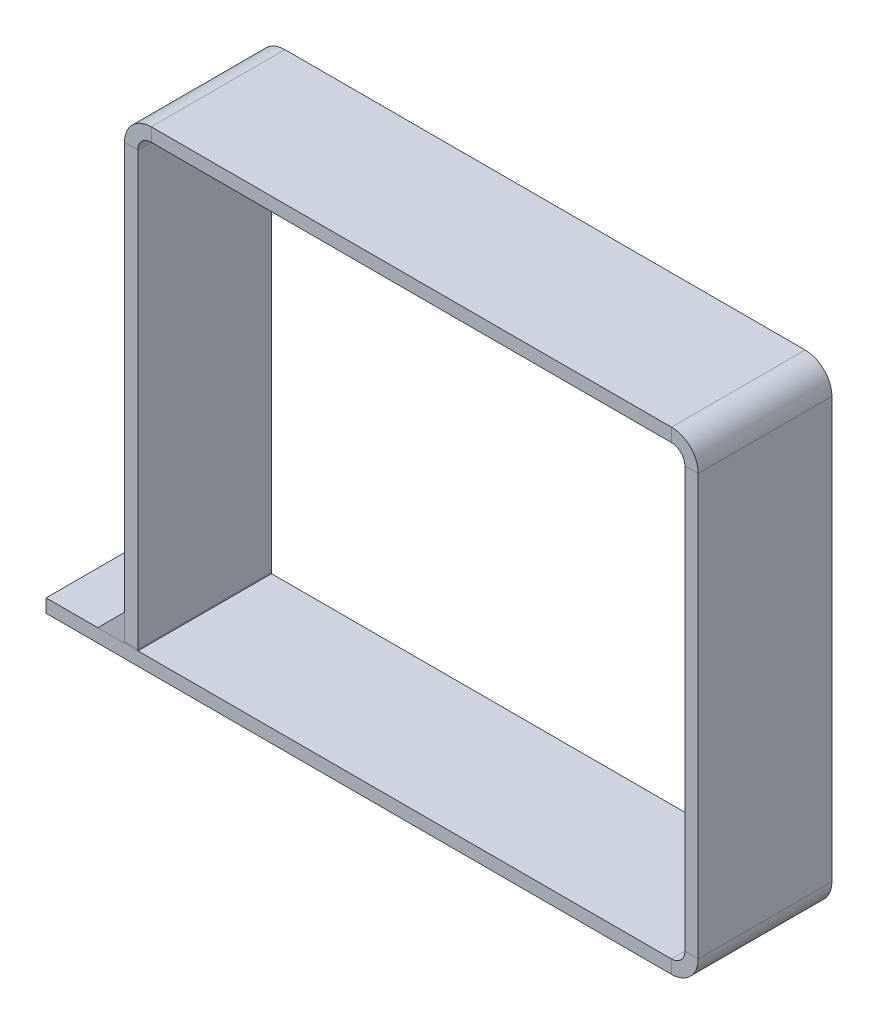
ISO-10303-21;
HEADER;
FILE_DESCRIPTION(('STEP AP214'),'2;1');
FILE_NAME('part.step','',(''),(''),'','','');
FILE_SCHEMA(('AUTOMOTIVE_DESIGN { 1 0 10303 214 1 1 1 1 }'));
ENDSEC;
DATA;
#1=APPLICATION_CONTEXT('core data for automotive mechanical design processes');
#2=APPLICATION_PROTOCOL_DEFINITION('international standard','automotive_design',2000,#1);
#3=PRODUCT_CONTEXT('',#1,'mechanical');
#4=PRODUCT('Part','Part','',(#3));
#5=PRODUCT_RELATED_PRODUCT_CATEGORY('part','',(#4));
#6=PRODUCT_DEFINITION_FORMATION('','',#4);
#7=PRODUCT_DEFINITION_CONTEXT('part definition',#1,'design');
#8=PRODUCT_DEFINITION('design','',#6,#7);
#9=PRODUCT_DEFINITION_SHAPE('','',#8);
#10=(LENGTH_UNIT() NAMED_UNIT(*) SI_UNIT(.MILLI.,.METRE.));
#11=(NAMED_UNIT(*) PLANE_ANGLE_UNIT() SI_UNIT($,.RADIAN.));
#12=(NAMED_UNIT(*) SI_UNIT($,.STERADIAN.) SOLID_ANGLE_UNIT());
#13=UNCERTAINTY_MEASURE_WITH_UNIT(LENGTH_MEASURE(1.E-05),#10,'distance_accuracy_value','');
#14=(GEOMETRIC_REPRESENTATION_CONTEXT(3) GLOBAL_UNCERTAINTY_ASSIGNED_CONTEXT((#13)) GLOBAL_UNIT_ASSIGNED_CONTEXT((#10,
#11,#12)) REPRESENTATION_CONTEXT('',''));
#15=CARTESIAN_POINT('',(0.,0.,0.));
#16=DIRECTION('',(0.,0.,1.));
#17=DIRECTION('',(1.,0.,0.));
#18=AXIS2_PLACEMENT_3D('',#15,#16,#17);
#19=CARTESIAN_POINT('',(7.86589769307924,32.4486459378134,10.));
#20=DIRECTION('',(0.,0.,-1.));
#21=DIRECTION('',(-1.,0.,0.));
#22=AXIS2_PLACEMENT_3D('',#19,#20,#21);
#23=PLANE('',#22);
#24=DIRECTION('',(-0.707106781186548,-0.707106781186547,0.));
#25=VECTOR('',#24,1.);
#26=CARTESIAN_POINT('',(22.090220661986,18.2243229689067,10.));
#27=LINE('',#26,#25);
#28=CARTESIAN_POINT('',(5.86589769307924,1.99999999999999,10.));
#29=VERTEX_POINT('',#28);
#30=CARTESIAN_POINT('',(3.86589769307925,0.,10.));
#31=VERTEX_POINT('',#30);
#32=EDGE_CURVE('E12',#29,#31,#27,.T.);
#33=ORIENTED_EDGE('',*,*,#32,.T.);
#34=DIRECTION('',(1.,0.,0.));
#35=VECTOR('',#34,1.);
#36=CARTESIAN_POINT('',(0.,0.,10.));
#37=LINE('',#36,#35);
#38=CARTESIAN_POINT('',(5.86589769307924,0.,10.));
#39=VERTEX_POINT('',#38);
#40=EDGE_CURVE('E85',#31,#39,#37,.T.);
#41=ORIENTED_EDGE('',*,*,#40,.T.);
#42=DIRECTION('',(0.,-1.,0.));
#43=VECTOR('',#42,1.);
#44=CARTESIAN_POINT('',(5.86589769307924,33.4486459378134,10.));
#45=LINE('',#44,#43);
#46=EDGE_CURVE('E76',#29,#39,#45,.T.);
#47=ORIENTED_EDGE('',*,*,#46,.F.);
#48=EDGE_LOOP('',(#33,#41,#47));
#49=FACE_BOUND('',#48,.T.);
#50=ADVANCED_FACE('F43',(#49),#23,.F.);
#51=CARTESIAN_POINT('',(7.86589769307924,32.4486459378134,0.));
#52=DIRECTION('',(0.,0.,-1.));
#53=DIRECTION('',(-1.,0.,0.));
#54=AXIS2_PLACEMENT_3D('',#51,#52,#53);
#55=PLANE('',#54);
#56=DIRECTION('',(1.,0.,0.));
#57=VECTOR('',#56,1.);
#58=CARTESIAN_POINT('',(0.,0.,0.));
#59=LINE('',#58,#57);
#60=CARTESIAN_POINT('',(3.86589769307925,0.,0.));
#61=VERTEX_POINT('',#60);
#62=CARTESIAN_POINT('',(5.86589769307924,0.,0.));
#63=VERTEX_POINT('',#62);
#64=EDGE_CURVE('E86',#61,#63,#59,.T.);
#65=ORIENTED_EDGE('',*,*,#64,.F.);
#66=DIRECTION('',(0.707106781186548,0.707106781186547,0.));
#67=VECTOR('',#66,1.);
#68=CARTESIAN_POINT('',(3.86589769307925,0.,0.));
#69=LINE('',#68,#67);
#70=CARTESIAN_POINT('',(5.86589769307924,1.99999999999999,0.));
#71=VERTEX_POINT('',#70);
#72=EDGE_CURVE('E50',#61,#71,#69,.T.);
#73=ORIENTED_EDGE('',*,*,#72,.T.);
#74=DIRECTION('',(0.,-1.,0.));
#75=VECTOR('',#74,1.);
#76=CARTESIAN_POINT('',(5.86589769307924,33.4486459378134,0.));
#77=LINE('',#76,#75);
#78=EDGE_CURVE('E57',#71,#63,#77,.T.);
#79=ORIENTED_EDGE('',*,*,#78,.T.);
#80=EDGE_LOOP('',(#65,#73,#79));
#81=FACE_BOUND('',#80,.T.);
#82=ADVANCED_FACE('F96',(#81),#55,.T.);
#83=CARTESIAN_POINT('',(3.86589769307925,0.,10.));
#84=DIRECTION('',(0.707106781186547,-0.707106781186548,0.));
#85=DIRECTION('',(0.707106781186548,0.707106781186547,0.));
#86=AXIS2_PLACEMENT_3D('',#83,#84,#85);
#87=PLANE('',#86);
#88=ORIENTED_EDGE('',*,*,#32,.F.);
#89=DIRECTION('',(0.,0.,1.));
#90=VECTOR('',#89,1.);
#91=CARTESIAN_POINT('',(5.86589769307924,1.99999999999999,10.));
#92=LINE('',#91,#90);
#93=EDGE_CURVE('E81',#71,#29,#92,.T.);
#94=ORIENTED_EDGE('',*,*,#93,.F.);
#95=ORIENTED_EDGE('',*,*,#72,.F.);
#96=DIRECTION('',(0.,0.,-1.));
#97=VECTOR('',#96,1.);
#98=CARTESIAN_POINT('',(3.86589769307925,0.,10.));
#99=LINE('',#98,#97);
#100=EDGE_CURVE('E65',#31,#61,#99,.T.);
#101=ORIENTED_EDGE('',*,*,#100,.F.);
#102=EDGE_LOOP('',(#88,#94,#95,#101));
#103=FACE_BOUND('',#102,.T.);
#104=ADVANCED_FACE('F98',(#103),#87,.F.);
#105=CARTESIAN_POINT('',(0.,0.,10.));
#106=DIRECTION('',(0.,1.,0.));
#107=DIRECTION('',(0.,0.,1.));
#108=AXIS2_PLACEMENT_3D('',#105,#106,#107);
#109=PLANE('',#108);
#110=ORIENTED_EDGE('',*,*,#64,.T.);
#111=DIRECTION('',(0.,0.,-1.));
#112=VECTOR('',#111,1.);
#113=CARTESIAN_POINT('',(5.86589769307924,0.,10.));
#114=LINE('',#113,#112);
#115=EDGE_CURVE('E79',#39,#63,#114,.T.);
#116=ORIENTED_EDGE('',*,*,#115,.F.);
#117=ORIENTED_EDGE('',*,*,#40,.F.);
#118=ORIENTED_EDGE('',*,*,#100,.T.);
#119=EDGE_LOOP('',(#110,#116,#117,#118));
#120=FACE_BOUND('',#119,.T.);
#121=ADVANCED_FACE('F88',(#120),#109,.F.);
#122=CARTESIAN_POINT('',(5.86589769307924,33.4486459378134,10.));
#123=DIRECTION('',(1.,0.,0.));
#124=DIRECTION('',(0.,1.,0.));
#125=AXIS2_PLACEMENT_3D('',#122,#123,#124);
#126=PLANE('',#125);
#127=ORIENTED_EDGE('',*,*,#93,.T.);
#128=ORIENTED_EDGE('',*,*,#46,.T.);
#129=ORIENTED_EDGE('',*,*,#115,.T.);
#130=ORIENTED_EDGE('',*,*,#78,.F.);
#131=EDGE_LOOP('',(#127,#128,#129,#130));
#132=FACE_BOUND('',#131,.T.);
#133=ADVANCED_FACE('F78',(#132),#126,.T.);
#134=CLOSED_SHELL('',(#50,#82,#104,#121,#133));
#135=MANIFOLD_SOLID_BREP('B2',#134);
#136=CARTESIAN_POINT('',(5.86589769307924,0.,10.));
#137=DIRECTION('',(1.,0.,0.));
#138=DIRECTION('',(0.,1.,0.));
#139=AXIS2_PLACEMENT_3D('',#136,#137,#138);
#140=PLANE('',#139);
#141=DIRECTION('',(0.,0.,-1.));
#142=VECTOR('',#141,1.);
#143=CARTESIAN_POINT('',(5.86589769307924,0.100000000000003,10.));
#144=LINE('',#143,#142);
#145=CARTESIAN_POINT('',(5.86589769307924,0.100000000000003,10.));
#146=VERTEX_POINT('',#145);
#147=CARTESIAN_POINT('',(5.86589769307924,0.100000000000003,0.));
#148=VERTEX_POINT('',#147);
#149=EDGE_CURVE('E197',#146,#148,#144,.T.);
#150=ORIENTED_EDGE('',*,*,#149,.T.);
#151=DIRECTION('',(0.,1.,0.));
#152=VECTOR('',#151,1.);
#153=CARTESIAN_POINT('',(5.86589769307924,0.,0.));
#154=LINE('',#153,#152);
#155=CARTESIAN_POINT('',(5.86589769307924,0.,0.));
#156=VERTEX_POINT('',#155);
#157=EDGE_CURVE('E41',#156,#148,#154,.T.);
#158=ORIENTED_EDGE('',*,*,#157,.F.);
#159=DIRECTION('',(0.,0.,-1.));
#160=VECTOR('',#159,1.);
#161=CARTESIAN_POINT('',(5.86589769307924,0.,10.));
#162=LINE('',#161,#160);
#163=CARTESIAN_POINT('',(5.86589769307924,0.,10.));
#164=VERTEX_POINT('',#163);
#165=EDGE_CURVE('E215',#164,#156,#162,.T.);
#166=ORIENTED_EDGE('',*,*,#165,.F.);
#167=DIRECTION('',(0.,1.,0.));
#168=VECTOR('',#167,1.);
#169=CARTESIAN_POINT('',(5.86589769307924,0.,10.));
#170=LINE('',#169,#168);
#171=EDGE_CURVE('E209',#164,#146,#170,.T.);
#172=ORIENTED_EDGE('',*,*,#171,.T.);
#173=EDGE_LOOP('',(#150,#158,#166,#172));
#174=FACE_BOUND('',#173,.T.);
#175=ADVANCED_FACE('F153',(#174),#140,.F.);
#176=CARTESIAN_POINT('',(5.86589769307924,0.,0.));
#177=DIRECTION('',(0.,0.,1.));
#178=DIRECTION('',(1.,0.,0.));
#179=AXIS2_PLACEMENT_3D('',#176,#177,#178);
#180=PLANE('',#179);
#181=DIRECTION('',(1.,0.,0.));
#182=VECTOR('',#181,1.);
#183=CARTESIAN_POINT('',(5.86589769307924,0.100000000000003,0.));
#184=LINE('',#183,#182);
#185=CARTESIAN_POINT('',(6.86589769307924,0.0999999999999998,0.));
#186=VERTEX_POINT('',#185);
#187=EDGE_CURVE('E193',#148,#186,#184,.T.);
#188=ORIENTED_EDGE('',*,*,#187,.T.);
#189=DIRECTION('',(0.,1.,0.));
#190=VECTOR('',#189,1.);
#191=CARTESIAN_POINT('',(6.86589769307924,0.,0.));
#192=LINE('',#191,#190);
#193=CARTESIAN_POINT('',(6.86589769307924,0.,0.));
#194=VERTEX_POINT('',#193);
#195=EDGE_CURVE('E160',#194,#186,#192,.T.);
#196=ORIENTED_EDGE('',*,*,#195,.F.);
#197=DIRECTION('',(1.,0.,0.));
#198=VECTOR('',#197,1.);
#199=CARTESIAN_POINT('',(5.86589769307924,0.,0.));
#200=LINE('',#199,#198);
#201=EDGE_CURVE('E205',#156,#194,#200,.T.);
#202=ORIENTED_EDGE('',*,*,#201,.F.);
#203=ORIENTED_EDGE('',*,*,#157,.T.);
#204=EDGE_LOOP('',(#188,#196,#202,#203));
#205=FACE_BOUND('',#204,.T.);
#206=ADVANCED_FACE('F204',(#205),#180,.F.);
#207=CARTESIAN_POINT('',(6.86589769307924,0.,0.));
#208=DIRECTION('',(-1.,0.,0.));
#209=DIRECTION('',(0.,-1.,0.));
#210=AXIS2_PLACEMENT_3D('',#207,#208,#209);
#211=PLANE('',#210);
#212=DIRECTION('',(0.,0.,1.));
#213=VECTOR('',#212,1.);
#214=CARTESIAN_POINT('',(6.86589769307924,0.0999999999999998,0.));
#215=LINE('',#214,#213);
#216=CARTESIAN_POINT('',(6.86589769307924,0.0999999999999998,10.));
#217=VERTEX_POINT('',#216);
#218=EDGE_CURVE('E198',#186,#217,#215,.T.);
#219=ORIENTED_EDGE('',*,*,#218,.T.);
#220=DIRECTION('',(0.,1.,0.));
#221=VECTOR('',#220,1.);
#222=CARTESIAN_POINT('',(6.86589769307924,0.,10.));
#223=LINE('',#222,#221);
#224=CARTESIAN_POINT('',(6.86589769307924,0.,10.));
#225=VERTEX_POINT('',#224);
#226=EDGE_CURVE('E221',#225,#217,#223,.T.);
#227=ORIENTED_EDGE('',*,*,#226,.F.);
#228=DIRECTION('',(0.,0.,1.));
#229=VECTOR('',#228,1.);
#230=CARTESIAN_POINT('',(6.86589769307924,0.,0.));
#231=LINE('',#230,#229);
#232=EDGE_CURVE('E172',#194,#225,#231,.T.);
#233=ORIENTED_EDGE('',*,*,#232,.F.);
#234=ORIENTED_EDGE('',*,*,#195,.T.);
#235=EDGE_LOOP('',(#219,#227,#233,#234));
#236=FACE_BOUND('',#235,.T.);
#237=ADVANCED_FACE('F224',(#236),#211,.F.);
#238=CARTESIAN_POINT('',(6.86589769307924,0.,10.));
#239=DIRECTION('',(0.,0.,-1.));
#240=DIRECTION('',(-1.,0.,0.));
#241=AXIS2_PLACEMENT_3D('',#238,#239,#240);
#242=PLANE('',#241);
#243=DIRECTION('',(-1.,0.,0.));
#244=VECTOR('',#243,1.);
#245=CARTESIAN_POINT('',(6.86589769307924,0.0999999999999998,10.));
#246=LINE('',#245,#244);
#247=EDGE_CURVE('E213',#217,#146,#246,.T.);
#248=ORIENTED_EDGE('',*,*,#247,.T.);
#249=ORIENTED_EDGE('',*,*,#171,.F.);
#250=DIRECTION('',(-1.,0.,0.));
#251=VECTOR('',#250,1.);
#252=CARTESIAN_POINT('',(6.86589769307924,0.,10.));
#253=LINE('',#252,#251);
#254=EDGE_CURVE('E167',#225,#164,#253,.T.);
#255=ORIENTED_EDGE('',*,*,#254,.F.);
#256=ORIENTED_EDGE('',*,*,#226,.T.);
#257=EDGE_LOOP('',(#248,#249,#255,#256));
#258=FACE_BOUND('',#257,.T.);
#259=ADVANCED_FACE('F226',(#258),#242,.F.);
#260=CARTESIAN_POINT('',(5.86589769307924,0.,0.));
#261=DIRECTION('',(0.,-1.,0.));
#262=DIRECTION('',(1.,0.,0.));
#263=AXIS2_PLACEMENT_3D('',#260,#261,#262);
#264=PLANE('',#263);
#265=ORIENTED_EDGE('',*,*,#165,.T.);
#266=ORIENTED_EDGE('',*,*,#201,.T.);
#267=ORIENTED_EDGE('',*,*,#232,.T.);
#268=ORIENTED_EDGE('',*,*,#254,.T.);
#269=EDGE_LOOP('',(#265,#266,#267,#268));
#270=FACE_BOUND('',#269,.T.);
#271=ADVANCED_FACE('F227',(#270),#264,.T.);
#272=CARTESIAN_POINT('',(5.86589769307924,0.100000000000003,0.));
#273=DIRECTION('',(0.,-1.,0.));
#274=DIRECTION('',(1.,0.,0.));
#275=AXIS2_PLACEMENT_3D('',#272,#273,#274);
#276=PLANE('',#275);
#277=ORIENTED_EDGE('',*,*,#149,.F.);
#278=ORIENTED_EDGE('',*,*,#247,.F.);
#279=ORIENTED_EDGE('',*,*,#218,.F.);
#280=ORIENTED_EDGE('',*,*,#187,.F.);
#281=EDGE_LOOP('',(#277,#278,#279,#280));
#282=FACE_BOUND('',#281,.T.);
#283=ADVANCED_FACE('F194',(#282),#276,.F.);
#284=CLOSED_SHELL('',(#175,#206,#237,#259,#271,#283));
#285=MANIFOLD_SOLID_BREP('B6',#284);
#286=CARTESIAN_POINT('',(47.7810431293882,1.,10.));
#287=DIRECTION('',(0.,0.,1.));
#288=DIRECTION('',(1.,0.,0.));
#289=AXIS2_PLACEMENT_3D('',#286,#287,#288);
#290=PLANE('',#289);
#291=DIRECTION('',(1.,0.,0.));
#292=VECTOR('',#291,1.);
#293=CARTESIAN_POINT('',(47.7810431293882,1.,10.));
#294=LINE('',#293,#292);
#295=CARTESIAN_POINT('',(47.7810431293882,1.,10.));
#296=VERTEX_POINT('',#295);
#297=CARTESIAN_POINT('',(48.7810431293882,1.,10.));
#298=VERTEX_POINT('',#297);
#299=EDGE_CURVE('E151',#296,#298,#294,.T.);
#300=ORIENTED_EDGE('',*,*,#299,.F.);
#301=CARTESIAN_POINT('',(46.7810431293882,1.,10.));
#302=DIRECTION('',(0.,0.,-1.));
#303=DIRECTION('',(-1.,0.,0.));
#304=AXIS2_PLACEMENT_3D('',#301,#302,#303);
#305=CIRCLE('',#304,1.);
#306=CARTESIAN_POINT('',(46.7810431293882,0.,10.));
#307=VERTEX_POINT('',#306);
#308=EDGE_CURVE('E462',#307,#296,#305,.F.);
#309=ORIENTED_EDGE('',*,*,#308,.F.);
#310=DIRECTION('',(0.,1.,0.));
#311=VECTOR('',#310,1.);
#312=CARTESIAN_POINT('',(46.7810431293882,-1.,10.));
#313=LINE('',#312,#311);
#314=CARTESIAN_POINT('',(46.7810431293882,-1.,10.));
#315=VERTEX_POINT('',#314);
#316=EDGE_CURVE('E273',#315,#307,#313,.T.);
#317=ORIENTED_EDGE('',*,*,#316,.F.);
#318=CARTESIAN_POINT('',(46.7810431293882,1.,10.));
#319=DIRECTION('',(0.,0.,1.));
#320=DIRECTION('',(1.,0.,0.));
#321=AXIS2_PLACEMENT_3D('',#318,#319,#320);
#322=CIRCLE('',#321,2.);
#323=EDGE_CURVE('E474',#315,#298,#322,.T.);
#324=ORIENTED_EDGE('',*,*,#323,.T.);
#325=EDGE_LOOP('',(#300,#309,#317,#324));
#326=FACE_BOUND('',#325,.T.);
#327=ADVANCED_FACE('F266',(#326),#290,.T.);
#328=CARTESIAN_POINT('',(46.7810431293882,-1.,10.));
#329=DIRECTION('',(0.,0.,1.));
#330=DIRECTION('',(1.,0.,0.));
#331=AXIS2_PLACEMENT_3D('',#328,#329,#330);
#332=PLANE('',#331);
#333=DIRECTION('',(0.,1.,0.));
#334=VECTOR('',#333,1.);
#335=CARTESIAN_POINT('',(47.7810431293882,0.,10.));
#336=LINE('',#335,#334);
#337=CARTESIAN_POINT('',(47.7810431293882,32.4486459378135,10.));
#338=VERTEX_POINT('',#337);
#339=EDGE_CURVE('E459',#296,#338,#336,.T.);
#340=ORIENTED_EDGE('',*,*,#339,.F.);
#341=ORIENTED_EDGE('',*,*,#299,.T.);
#342=DIRECTION('',(0.,1.,0.));
#343=VECTOR('',#342,1.);
#344=CARTESIAN_POINT('',(48.7810431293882,0.,10.));
#345=LINE('',#344,#343);
#346=CARTESIAN_POINT('',(48.7810431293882,32.4486459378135,10.));
#347=VERTEX_POINT('',#346);
#348=EDGE_CURVE('E477',#298,#347,#345,.T.);
#349=ORIENTED_EDGE('',*,*,#348,.T.);
#350=DIRECTION('',(-1.,0.,0.));
#351=VECTOR('',#350,1.);
#352=CARTESIAN_POINT('',(48.7810431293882,32.4486459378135,10.));
#353=LINE('',#352,#351);
#354=EDGE_CURVE('E535',#347,#338,#353,.T.);
#355=ORIENTED_EDGE('',*,*,#354,.T.);
#356=EDGE_LOOP('',(#340,#341,#349,#355));
#357=FACE_BOUND('',#356,.T.);
#358=ADVANCED_FACE('F577',(#357),#332,.T.);
#359=CARTESIAN_POINT('',(46.7810431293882,0.,0.));
#360=DIRECTION('',(0.,0.,-1.));
#361=DIRECTION('',(-1.,0.,0.));
#362=AXIS2_PLACEMENT_3D('',#359,#360,#361);
#363=PLANE('',#362);
#364=DIRECTION('',(0.,-1.,0.));
#365=VECTOR('',#364,1.);
#366=CARTESIAN_POINT('',(46.7810431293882,0.,0.));
#367=LINE('',#366,#365);
#368=CARTESIAN_POINT('',(46.7810431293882,0.,0.));
#369=VERTEX_POINT('',#368);
#370=CARTESIAN_POINT('',(46.7810431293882,-1.,0.));
#371=VERTEX_POINT('',#370);
#372=EDGE_CURVE('E541',#369,#371,#367,.T.);
#373=ORIENTED_EDGE('',*,*,#372,.F.);
#374=CARTESIAN_POINT('',(46.7810431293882,1.,0.));
#375=DIRECTION('',(0.,0.,-1.));
#376=DIRECTION('',(-1.,0.,0.));
#377=AXIS2_PLACEMENT_3D('',#374,#375,#376);
#378=CIRCLE('',#377,1.);
#379=CARTESIAN_POINT('',(47.7810431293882,1.,0.));
#380=VERTEX_POINT('',#379);
#381=EDGE_CURVE('E417',#369,#380,#378,.F.);
#382=ORIENTED_EDGE('',*,*,#381,.T.);
#383=DIRECTION('',(-1.,0.,0.));
#384=VECTOR('',#383,1.);
#385=CARTESIAN_POINT('',(48.7810431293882,1.,0.));
#386=LINE('',#385,#384);
#387=CARTESIAN_POINT('',(48.7810431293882,1.,0.));
#388=VERTEX_POINT('',#387);
#389=EDGE_CURVE('E539',#388,#380,#386,.T.);
#390=ORIENTED_EDGE('',*,*,#389,.F.);
#391=CARTESIAN_POINT('',(46.7810431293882,1.,0.));
#392=DIRECTION('',(0.,0.,1.));
#393=DIRECTION('',(1.,0.,0.));
#394=AXIS2_PLACEMENT_3D('',#391,#392,#393);
#395=CIRCLE('',#394,2.);
#396=EDGE_CURVE('E429',#371,#388,#395,.T.);
#397=ORIENTED_EDGE('',*,*,#396,.F.);
#398=EDGE_LOOP('',(#373,#382,#390,#397));
#399=FACE_BOUND('',#398,.T.);
#400=ADVANCED_FACE('F585',(#399),#363,.T.);
#401=CARTESIAN_POINT('',(48.7810431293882,1.,0.));
#402=DIRECTION('',(0.,0.,-1.));
#403=DIRECTION('',(-1.,0.,0.));
#404=AXIS2_PLACEMENT_3D('',#401,#402,#403);
#405=PLANE('',#404);
#406=DIRECTION('',(1.,0.,0.));
#407=VECTOR('',#406,1.);
#408=CARTESIAN_POINT('',(0.,0.,0.));
#409=LINE('',#408,#407);
#410=CARTESIAN_POINT('',(0.,0.,0.));
#411=VERTEX_POINT('',#410);
#412=EDGE_CURVE('E420',#411,#369,#409,.T.);
#413=ORIENTED_EDGE('',*,*,#412,.T.);
#414=ORIENTED_EDGE('',*,*,#372,.T.);
#415=DIRECTION('',(1.,0.,0.));
#416=VECTOR('',#415,1.);
#417=CARTESIAN_POINT('',(0.,-1.,0.));
#418=LINE('',#417,#416);
#419=CARTESIAN_POINT('',(0.,-1.,0.));
#420=VERTEX_POINT('',#419);
#421=EDGE_CURVE('E426',#420,#371,#418,.T.);
#422=ORIENTED_EDGE('',*,*,#421,.F.);
#423=DIRECTION('',(0.,1.,0.));
#424=VECTOR('',#423,1.);
#425=CARTESIAN_POINT('',(0.,-1.,0.));
#426=LINE('',#425,#424);
#427=EDGE_CURVE('E423',#420,#411,#426,.T.);
#428=ORIENTED_EDGE('',*,*,#427,.T.);
#429=EDGE_LOOP('',(#413,#414,#422,#428));
#430=FACE_BOUND('',#429,.T.);
#431=ADVANCED_FACE('F587',(#430),#405,.T.);
#432=CARTESIAN_POINT('',(46.7810431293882,33.4486459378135,10.));
#433=DIRECTION('',(0.,0.,1.));
#434=DIRECTION('',(1.,0.,0.));
#435=AXIS2_PLACEMENT_3D('',#432,#433,#434);
#436=PLANE('',#435);
#437=DIRECTION('',(0.,1.,0.));
#438=VECTOR('',#437,1.);
#439=CARTESIAN_POINT('',(46.7810431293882,33.4486459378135,10.));
#440=LINE('',#439,#438);
#441=CARTESIAN_POINT('',(46.7810431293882,33.4486459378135,10.));
#442=VERTEX_POINT('',#441);
#443=CARTESIAN_POINT('',(46.7810431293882,34.4486459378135,10.));
#444=VERTEX_POINT('',#443);
#445=EDGE_CURVE('E537',#442,#444,#440,.T.);
#446=ORIENTED_EDGE('',*,*,#445,.F.);
#447=CARTESIAN_POINT('',(46.7810431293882,32.4486459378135,10.));
#448=DIRECTION('',(0.,0.,-1.));
#449=DIRECTION('',(-1.,0.,0.));
#450=AXIS2_PLACEMENT_3D('',#447,#448,#449);
#451=CIRCLE('',#450,1.);
#452=EDGE_CURVE('E456',#338,#442,#451,.F.);
#453=ORIENTED_EDGE('',*,*,#452,.F.);
#454=ORIENTED_EDGE('',*,*,#354,.F.);
#455=CARTESIAN_POINT('',(46.7810431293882,32.4486459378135,10.));
#456=DIRECTION('',(0.,0.,1.));
#457=DIRECTION('',(1.,0.,0.));
#458=AXIS2_PLACEMENT_3D('',#455,#456,#457);
#459=CIRCLE('',#458,2.);
#460=EDGE_CURVE('E480',#347,#444,#459,.T.);
#461=ORIENTED_EDGE('',*,*,#460,.T.);
#462=EDGE_LOOP('',(#446,#453,#454,#461));
#463=FACE_BOUND('',#462,.T.);
#464=ADVANCED_FACE('F589',(#463),#436,.T.);
#465=CARTESIAN_POINT('',(48.7810431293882,32.4486459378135,10.));
#466=DIRECTION('',(0.,0.,1.));
#467=DIRECTION('',(1.,0.,0.));
#468=AXIS2_PLACEMENT_3D('',#465,#466,#467);
#469=PLANE('',#468);
#470=DIRECTION('',(-1.,0.,0.));
#471=VECTOR('',#470,1.);
#472=CARTESIAN_POINT('',(47.7810431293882,33.4486459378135,10.));
#473=LINE('',#472,#471);
#474=CARTESIAN_POINT('',(7.86589769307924,33.4486459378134,10.));
#475=VERTEX_POINT('',#474);
#476=EDGE_CURVE('E453',#442,#475,#473,.T.);
#477=ORIENTED_EDGE('',*,*,#476,.F.);
#478=ORIENTED_EDGE('',*,*,#445,.T.);
#479=DIRECTION('',(-1.,0.,0.));
#480=VECTOR('',#479,1.);
#481=CARTESIAN_POINT('',(47.7810431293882,34.4486459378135,10.));
#482=LINE('',#481,#480);
#483=CARTESIAN_POINT('',(7.86589769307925,34.4486459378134,10.));
#484=VERTEX_POINT('',#483);
#485=EDGE_CURVE('E483',#444,#484,#482,.T.);
#486=ORIENTED_EDGE('',*,*,#485,.T.);
#487=DIRECTION('',(0.,-1.,0.));
#488=VECTOR('',#487,1.);
#489=CARTESIAN_POINT('',(7.86589769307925,34.4486459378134,10.));
#490=LINE('',#489,#488);
#491=EDGE_CURVE('E287',#484,#475,#490,.T.);
#492=ORIENTED_EDGE('',*,*,#491,.T.);
#493=EDGE_LOOP('',(#477,#478,#486,#492));
#494=FACE_BOUND('',#493,.T.);
#495=ADVANCED_FACE('F595',(#494),#469,.T.);
#496=CARTESIAN_POINT('',(47.7810431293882,32.4486459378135,0.));
#497=DIRECTION('',(0.,0.,-1.));
#498=DIRECTION('',(-1.,0.,0.));
#499=AXIS2_PLACEMENT_3D('',#496,#497,#498);
#500=PLANE('',#499);
#501=DIRECTION('',(1.,0.,0.));
#502=VECTOR('',#501,1.);
#503=CARTESIAN_POINT('',(47.7810431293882,32.4486459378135,0.));
#504=LINE('',#503,#502);
#505=CARTESIAN_POINT('',(47.7810431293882,32.4486459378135,0.));
#506=VERTEX_POINT('',#505);
#507=CARTESIAN_POINT('',(48.7810431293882,32.4486459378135,0.));
#508=VERTEX_POINT('',#507);
#509=EDGE_CURVE('E533',#506,#508,#504,.T.);
#510=ORIENTED_EDGE('',*,*,#509,.F.);
#511=CARTESIAN_POINT('',(46.7810431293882,32.4486459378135,0.));
#512=DIRECTION('',(0.,0.,-1.));
#513=DIRECTION('',(-1.,0.,0.));
#514=AXIS2_PLACEMENT_3D('',#511,#512,#513);
#515=CIRCLE('',#514,1.);
#516=CARTESIAN_POINT('',(46.7810431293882,33.4486459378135,0.));
#517=VERTEX_POINT('',#516);
#518=EDGE_CURVE('E411',#506,#517,#515,.F.);
#519=ORIENTED_EDGE('',*,*,#518,.T.);
#520=DIRECTION('',(0.,-1.,0.));
#521=VECTOR('',#520,1.);
#522=CARTESIAN_POINT('',(46.7810431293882,34.4486459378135,0.));
#523=LINE('',#522,#521);
#524=CARTESIAN_POINT('',(46.7810431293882,34.4486459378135,0.));
#525=VERTEX_POINT('',#524);
#526=EDGE_CURVE('E531',#525,#517,#523,.T.);
#527=ORIENTED_EDGE('',*,*,#526,.F.);
#528=CARTESIAN_POINT('',(46.7810431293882,32.4486459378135,0.));
#529=DIRECTION('',(0.,0.,1.));
#530=DIRECTION('',(1.,0.,0.));
#531=AXIS2_PLACEMENT_3D('',#528,#529,#530);
#532=CIRCLE('',#531,2.);
#533=EDGE_CURVE('E435',#508,#525,#532,.T.);
#534=ORIENTED_EDGE('',*,*,#533,.F.);
#535=EDGE_LOOP('',(#510,#519,#527,#534));
#536=FACE_BOUND('',#535,.T.);
#537=ADVANCED_FACE('F634',(#536),#500,.T.);
#538=CARTESIAN_POINT('',(46.7810431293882,34.4486459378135,0.));
#539=DIRECTION('',(0.,0.,-1.));
#540=DIRECTION('',(-1.,0.,0.));
#541=AXIS2_PLACEMENT_3D('',#538,#539,#540);
#542=PLANE('',#541);
#543=DIRECTION('',(0.,1.,0.));
#544=VECTOR('',#543,1.);
#545=CARTESIAN_POINT('',(47.7810431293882,0.,0.));
#546=LINE('',#545,#544);
#547=EDGE_CURVE('E414',#380,#506,#546,.T.);
#548=ORIENTED_EDGE('',*,*,#547,.T.);
#549=ORIENTED_EDGE('',*,*,#509,.T.);
#550=DIRECTION('',(0.,1.,0.));
#551=VECTOR('',#550,1.);
#552=CARTESIAN_POINT('',(48.7810431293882,0.,0.));
#553=LINE('',#552,#551);
#554=EDGE_CURVE('E432',#388,#508,#553,.T.);
#555=ORIENTED_EDGE('',*,*,#554,.F.);
#556=ORIENTED_EDGE('',*,*,#389,.T.);
#557=EDGE_LOOP('',(#548,#549,#555,#556));
#558=FACE_BOUND('',#557,.T.);
#559=ADVANCED_FACE('F644',(#558),#542,.T.);
#560=CARTESIAN_POINT('',(6.86589769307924,32.4486459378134,10.));
#561=DIRECTION('',(0.,0.,1.));
#562=DIRECTION('',(1.,0.,0.));
#563=AXIS2_PLACEMENT_3D('',#560,#561,#562);
#564=PLANE('',#563);
#565=DIRECTION('',(-1.,0.,0.));
#566=VECTOR('',#565,1.);
#567=CARTESIAN_POINT('',(6.86589769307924,32.4486459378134,10.));
#568=LINE('',#567,#566);
#569=CARTESIAN_POINT('',(6.86589769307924,32.4486459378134,10.));
#570=VERTEX_POINT('',#569);
#571=CARTESIAN_POINT('',(5.86589769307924,32.4486459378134,10.));
#572=VERTEX_POINT('',#571);
#573=EDGE_CURVE('E280',#570,#572,#568,.T.);
#574=ORIENTED_EDGE('',*,*,#573,.F.);
#575=CARTESIAN_POINT('',(7.86589769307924,32.4486459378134,10.));
#576=DIRECTION('',(0.,0.,-1.));
#577=DIRECTION('',(-1.,0.,0.));
#578=AXIS2_PLACEMENT_3D('',#575,#576,#577);
#579=CIRCLE('',#578,1.);
#580=EDGE_CURVE('E450',#475,#570,#579,.F.);
#581=ORIENTED_EDGE('',*,*,#580,.F.);
#582=ORIENTED_EDGE('',*,*,#491,.F.);
#583=CARTESIAN_POINT('',(7.86589769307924,32.4486459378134,10.));
#584=DIRECTION('',(0.,0.,1.));
#585=DIRECTION('',(1.,0.,0.));
#586=AXIS2_PLACEMENT_3D('',#583,#584,#585);
#587=CIRCLE('',#586,2.);
#588=EDGE_CURVE('E485',#484,#572,#587,.T.);
#589=ORIENTED_EDGE('',*,*,#588,.T.);
#590=EDGE_LOOP('',(#574,#581,#582,#589));
#591=FACE_BOUND('',#590,.T.);
#592=ADVANCED_FACE('F654',(#591),#564,.T.);
#593=CARTESIAN_POINT('',(7.86589769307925,34.4486459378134,10.));
#594=DIRECTION('',(0.,0.,1.));
#595=DIRECTION('',(1.,0.,0.));
#596=AXIS2_PLACEMENT_3D('',#593,#594,#595);
#597=PLANE('',#596);
#598=DIRECTION('',(0.,-1.,0.));
#599=VECTOR('',#598,1.);
#600=CARTESIAN_POINT('',(6.86589769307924,33.4486459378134,10.));
#601=LINE('',#600,#599);
#602=CARTESIAN_POINT('',(6.86589769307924,0.0999999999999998,10.));
#603=VERTEX_POINT('',#602);
#604=EDGE_CURVE('E447',#570,#603,#601,.T.);
#605=ORIENTED_EDGE('',*,*,#604,.F.);
#606=ORIENTED_EDGE('',*,*,#573,.T.);
#607=DIRECTION('',(0.,-1.,0.));
#608=VECTOR('',#607,1.);
#609=CARTESIAN_POINT('',(5.86589769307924,33.4486459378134,10.));
#610=LINE('',#609,#608);
#611=CARTESIAN_POINT('',(5.86589769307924,0.100000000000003,10.));
#612=VERTEX_POINT('',#611);
#613=EDGE_CURVE('E444',#572,#612,#610,.T.);
#614=ORIENTED_EDGE('',*,*,#613,.T.);
#615=DIRECTION('',(-1.,0.,0.));
#616=VECTOR('',#615,1.);
#617=CARTESIAN_POINT('',(6.86589769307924,0.0999999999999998,10.));
#618=LINE('',#617,#616);
#619=EDGE_CURVE('E385',#603,#612,#618,.T.);
#620=ORIENTED_EDGE('',*,*,#619,.F.);
#621=EDGE_LOOP('',(#605,#606,#614,#620));
#622=FACE_BOUND('',#621,.T.);
#623=ADVANCED_FACE('F664',(#622),#597,.T.);
#624=CARTESIAN_POINT('',(7.86589769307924,33.4486459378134,0.));
#625=DIRECTION('',(0.,0.,-1.));
#626=DIRECTION('',(-1.,0.,0.));
#627=AXIS2_PLACEMENT_3D('',#624,#625,#626);
#628=PLANE('',#627);
#629=DIRECTION('',(0.,1.,0.));
#630=VECTOR('',#629,1.);
#631=CARTESIAN_POINT('',(7.86589769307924,33.4486459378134,0.));
#632=LINE('',#631,#630);
#633=CARTESIAN_POINT('',(7.86589769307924,33.4486459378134,0.));
#634=VERTEX_POINT('',#633);
#635=CARTESIAN_POINT('',(7.86589769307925,34.4486459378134,0.));
#636=VERTEX_POINT('',#635);
#637=EDGE_CURVE('E527',#634,#636,#632,.T.);
#638=ORIENTED_EDGE('',*,*,#637,.F.);
#639=CARTESIAN_POINT('',(7.86589769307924,32.4486459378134,0.));
#640=DIRECTION('',(0.,0.,-1.));
#641=DIRECTION('',(-1.,0.,0.));
#642=AXIS2_PLACEMENT_3D('',#639,#640,#641);
#643=CIRCLE('',#642,1.);
#644=CARTESIAN_POINT('',(6.86589769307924,32.4486459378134,0.));
#645=VERTEX_POINT('',#644);
#646=EDGE_CURVE('E403',#634,#645,#643,.F.);
#647=ORIENTED_EDGE('',*,*,#646,.T.);
#648=DIRECTION('',(1.,0.,0.));
#649=VECTOR('',#648,1.);
#650=CARTESIAN_POINT('',(5.86589769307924,32.4486459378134,0.));
#651=LINE('',#650,#649);
#652=CARTESIAN_POINT('',(5.86589769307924,32.4486459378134,0.));
#653=VERTEX_POINT('',#652);
#654=EDGE_CURVE('E388',#653,#645,#651,.T.);
#655=ORIENTED_EDGE('',*,*,#654,.F.);
#656=CARTESIAN_POINT('',(7.86589769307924,32.4486459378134,0.));
#657=DIRECTION('',(0.,0.,1.));
#658=DIRECTION('',(1.,0.,0.));
#659=AXIS2_PLACEMENT_3D('',#656,#657,#658);
#660=CIRCLE('',#659,2.);
#661=EDGE_CURVE('E441',#636,#653,#660,.T.);
#662=ORIENTED_EDGE('',*,*,#661,.F.);
#663=EDGE_LOOP('',(#638,#647,#655,#662));
#664=FACE_BOUND('',#663,.T.);
#665=ADVANCED_FACE('F674',(#664),#628,.T.);
#666=CARTESIAN_POINT('',(5.86589769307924,32.4486459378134,0.));
#667=DIRECTION('',(0.,0.,-1.));
#668=DIRECTION('',(-1.,0.,0.));
#669=AXIS2_PLACEMENT_3D('',#666,#667,#668);
#670=PLANE('',#669);
#671=DIRECTION('',(-1.,0.,0.));
#672=VECTOR('',#671,1.);
#673=CARTESIAN_POINT('',(47.7810431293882,33.4486459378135,0.));
#674=LINE('',#673,#672);
#675=EDGE_CURVE('E408',#517,#634,#674,.T.);
#676=ORIENTED_EDGE('',*,*,#675,.T.);
#677=ORIENTED_EDGE('',*,*,#637,.T.);
#678=DIRECTION('',(-1.,0.,0.));
#679=VECTOR('',#678,1.);
#680=CARTESIAN_POINT('',(47.7810431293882,34.4486459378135,0.));
#681=LINE('',#680,#679);
#682=EDGE_CURVE('E438',#525,#636,#681,.T.);
#683=ORIENTED_EDGE('',*,*,#682,.F.);
#684=ORIENTED_EDGE('',*,*,#526,.T.);
#685=EDGE_LOOP('',(#676,#677,#683,#684));
#686=FACE_BOUND('',#685,.T.);
#687=ADVANCED_FACE('F683',(#686),#670,.T.);
#688=CARTESIAN_POINT('',(5.86589769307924,33.4486459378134,10.));
#689=DIRECTION('',(1.,0.,0.));
#690=DIRECTION('',(0.,1.,0.));
#691=AXIS2_PLACEMENT_3D('',#688,#689,#690);
#692=PLANE('',#691);
#693=DIRECTION('',(0.,-1.,0.));
#694=VECTOR('',#693,1.);
#695=CARTESIAN_POINT('',(5.86589769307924,33.4486459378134,0.));
#696=LINE('',#695,#694);
#697=CARTESIAN_POINT('',(5.86589769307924,0.100000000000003,0.));
#698=VERTEX_POINT('',#697);
#699=EDGE_CURVE('E393',#653,#698,#696,.T.);
#700=ORIENTED_EDGE('',*,*,#699,.T.);
#701=DIRECTION('',(0.,0.,-1.));
#702=VECTOR('',#701,1.);
#703=CARTESIAN_POINT('',(5.86589769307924,0.100000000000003,10.));
#704=LINE('',#703,#702);
#705=EDGE_CURVE('E378',#612,#698,#704,.T.);
#706=ORIENTED_EDGE('',*,*,#705,.F.);
#707=ORIENTED_EDGE('',*,*,#613,.F.);
#708=DIRECTION('',(0.,0.,-1.));
#709=VECTOR('',#708,1.);
#710=CARTESIAN_POINT('',(5.86589769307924,32.4486459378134,10.));
#711=LINE('',#710,#709);
#712=EDGE_CURVE('E396',#572,#653,#711,.T.);
#713=ORIENTED_EDGE('',*,*,#712,.T.);
#714=EDGE_LOOP('',(#700,#706,#707,#713));
#715=FACE_BOUND('',#714,.T.);
#716=ADVANCED_FACE('F394',(#715),#692,.F.);
#717=CARTESIAN_POINT('',(6.86589769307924,0.0999999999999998,10.));
#718=DIRECTION('',(0.,-1.,0.));
#719=DIRECTION('',(1.,0.,0.));
#720=AXIS2_PLACEMENT_3D('',#717,#718,#719);
#721=PLANE('',#720);
#722=DIRECTION('',(-1.,0.,0.));
#723=VECTOR('',#722,1.);
#724=CARTESIAN_POINT('',(6.86589769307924,0.0999999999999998,0.));
#725=LINE('',#724,#723);
#726=CARTESIAN_POINT('',(6.86589769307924,0.0999999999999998,0.));
#727=VERTEX_POINT('',#726);
#728=EDGE_CURVE('E382',#727,#698,#725,.T.);
#729=ORIENTED_EDGE('',*,*,#728,.F.);
#730=DIRECTION('',(0.,0.,-1.));
#731=VECTOR('',#730,1.);
#732=CARTESIAN_POINT('',(6.86589769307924,0.0999999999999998,10.));
#733=LINE('',#732,#731);
#734=EDGE_CURVE('E389',#603,#727,#733,.T.);
#735=ORIENTED_EDGE('',*,*,#734,.F.);
#736=ORIENTED_EDGE('',*,*,#619,.T.);
#737=ORIENTED_EDGE('',*,*,#705,.T.);
#738=EDGE_LOOP('',(#729,#735,#736,#737));
#739=FACE_BOUND('',#738,.T.);
#740=ADVANCED_FACE('F380',(#739),#721,.T.);
#741=CARTESIAN_POINT('',(6.86589769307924,33.4486459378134,10.));
#742=DIRECTION('',(1.,0.,0.));
#743=DIRECTION('',(0.,1.,0.));
#744=AXIS2_PLACEMENT_3D('',#741,#742,#743);
#745=PLANE('',#744);
#746=DIRECTION('',(0.,-1.,0.));
#747=VECTOR('',#746,1.);
#748=CARTESIAN_POINT('',(6.86589769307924,33.4486459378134,0.));
#749=LINE('',#748,#747);
#750=EDGE_CURVE('E401',#645,#727,#749,.T.);
#751=ORIENTED_EDGE('',*,*,#750,.F.);
#752=DIRECTION('',(0.,0.,-1.));
#753=VECTOR('',#752,1.);
#754=CARTESIAN_POINT('',(6.86589769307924,32.4486459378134,10.));
#755=LINE('',#754,#753);
#756=EDGE_CURVE('E522',#570,#645,#755,.T.);
#757=ORIENTED_EDGE('',*,*,#756,.F.);
#758=ORIENTED_EDGE('',*,*,#604,.T.);
#759=ORIENTED_EDGE('',*,*,#734,.T.);
#760=EDGE_LOOP('',(#751,#757,#758,#759));
#761=FACE_BOUND('',#760,.T.);
#762=ADVANCED_FACE('F710',(#761),#745,.T.);
#763=CARTESIAN_POINT('',(7.86589769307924,32.4486459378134,10.));
#764=DIRECTION('',(0.,0.,-1.));
#765=DIRECTION('',(-1.,0.,0.));
#766=AXIS2_PLACEMENT_3D('',#763,#764,#765);
#767=CYLINDRICAL_SURFACE('',#766,1.);
#768=ORIENTED_EDGE('',*,*,#646,.F.);
#769=DIRECTION('',(0.,0.,-1.));
#770=VECTOR('',#769,1.);
#771=CARTESIAN_POINT('',(7.86589769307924,33.4486459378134,10.));
#772=LINE('',#771,#770);
#773=EDGE_CURVE('E519',#475,#634,#772,.T.);
#774=ORIENTED_EDGE('',*,*,#773,.F.);
#775=ORIENTED_EDGE('',*,*,#580,.T.);
#776=ORIENTED_EDGE('',*,*,#756,.T.);
#777=EDGE_LOOP('',(#768,#774,#775,#776));
#778=FACE_BOUND('',#777,.T.);
#779=ADVANCED_FACE('F719',(#778),#767,.F.);
#780=CARTESIAN_POINT('',(47.7810431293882,33.4486459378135,10.));
#781=DIRECTION('',(0.,-1.,0.));
#782=DIRECTION('',(1.,0.,0.));
#783=AXIS2_PLACEMENT_3D('',#780,#781,#782);
#784=PLANE('',#783);
#785=ORIENTED_EDGE('',*,*,#675,.F.);
#786=DIRECTION('',(0.,0.,-1.));
#787=VECTOR('',#786,1.);
#788=CARTESIAN_POINT('',(46.7810431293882,33.4486459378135,10.));
#789=LINE('',#788,#787);
#790=EDGE_CURVE('E516',#442,#517,#789,.T.);
#791=ORIENTED_EDGE('',*,*,#790,.F.);
#792=ORIENTED_EDGE('',*,*,#476,.T.);
#793=ORIENTED_EDGE('',*,*,#773,.T.);
#794=EDGE_LOOP('',(#785,#791,#792,#793));
#795=FACE_BOUND('',#794,.T.);
#796=ADVANCED_FACE('F730',(#795),#784,.T.);
#797=CARTESIAN_POINT('',(46.7810431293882,32.4486459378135,10.));
#798=DIRECTION('',(0.,0.,-1.));
#799=DIRECTION('',(-1.,0.,0.));
#800=AXIS2_PLACEMENT_3D('',#797,#798,#799);
#801=CYLINDRICAL_SURFACE('',#800,1.);
#802=ORIENTED_EDGE('',*,*,#518,.F.);
#803=DIRECTION('',(0.,0.,-1.));
#804=VECTOR('',#803,1.);
#805=CARTESIAN_POINT('',(47.7810431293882,32.4486459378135,10.));
#806=LINE('',#805,#804);
#807=EDGE_CURVE('E513',#338,#506,#806,.T.);
#808=ORIENTED_EDGE('',*,*,#807,.F.);
#809=ORIENTED_EDGE('',*,*,#452,.T.);
#810=ORIENTED_EDGE('',*,*,#790,.T.);
#811=EDGE_LOOP('',(#802,#808,#809,#810));
#812=FACE_BOUND('',#811,.T.);
#813=ADVANCED_FACE('F740',(#812),#801,.F.);
#814=CARTESIAN_POINT('',(47.7810431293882,0.,10.));
#815=DIRECTION('',(-1.,0.,0.));
#816=DIRECTION('',(0.,0.,1.));
#817=AXIS2_PLACEMENT_3D('',#814,#815,#816);
#818=PLANE('',#817);
#819=ORIENTED_EDGE('',*,*,#547,.F.);
#820=DIRECTION('',(0.,0.,-1.));
#821=VECTOR('',#820,1.);
#822=CARTESIAN_POINT('',(47.7810431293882,1.,10.));
#823=LINE('',#822,#821);
#824=EDGE_CURVE('E510',#296,#380,#823,.T.);
#825=ORIENTED_EDGE('',*,*,#824,.F.);
#826=ORIENTED_EDGE('',*,*,#339,.T.);
#827=ORIENTED_EDGE('',*,*,#807,.T.);
#828=EDGE_LOOP('',(#819,#825,#826,#827));
#829=FACE_BOUND('',#828,.T.);
#830=ADVANCED_FACE('F581',(#829),#818,.T.);
#831=CARTESIAN_POINT('',(46.7810431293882,1.,10.));
#832=DIRECTION('',(0.,0.,-1.));
#833=DIRECTION('',(-1.,0.,0.));
#834=AXIS2_PLACEMENT_3D('',#831,#832,#833);
#835=CYLINDRICAL_SURFACE('',#834,1.);
#836=ORIENTED_EDGE('',*,*,#381,.F.);
#837=DIRECTION('',(0.,0.,-1.));
#838=VECTOR('',#837,1.);
#839=CARTESIAN_POINT('',(46.7810431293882,0.,10.));
#840=LINE('',#839,#838);
#841=EDGE_CURVE('E507',#307,#369,#840,.T.);
#842=ORIENTED_EDGE('',*,*,#841,.F.);
#843=ORIENTED_EDGE('',*,*,#308,.T.);
#844=ORIENTED_EDGE('',*,*,#824,.T.);
#845=EDGE_LOOP('',(#836,#842,#843,#844));
#846=FACE_BOUND('',#845,.T.);
#847=ADVANCED_FACE('F553',(#846),#835,.F.);
#848=CARTESIAN_POINT('',(0.,0.,10.));
#849=DIRECTION('',(0.,1.,0.));
#850=DIRECTION('',(0.,0.,1.));
#851=AXIS2_PLACEMENT_3D('',#848,#849,#850);
#852=PLANE('',#851);
#853=ORIENTED_EDGE('',*,*,#412,.F.);
#854=DIRECTION('',(0.,0.,-1.));
#855=VECTOR('',#854,1.);
#856=CARTESIAN_POINT('',(0.,0.,10.));
#857=LINE('',#856,#855);
#858=CARTESIAN_POINT('',(0.,0.,10.));
#859=VERTEX_POINT('',#858);
#860=EDGE_CURVE('E505',#859,#411,#857,.T.);
#861=ORIENTED_EDGE('',*,*,#860,.F.);
#862=DIRECTION('',(1.,0.,0.));
#863=VECTOR('',#862,1.);
#864=CARTESIAN_POINT('',(0.,0.,10.));
#865=LINE('',#864,#863);
#866=EDGE_CURVE('E465',#859,#307,#865,.T.);
#867=ORIENTED_EDGE('',*,*,#866,.T.);
#868=ORIENTED_EDGE('',*,*,#841,.T.);
#869=EDGE_LOOP('',(#853,#861,#867,#868));
#870=FACE_BOUND('',#869,.T.);
#871=ADVANCED_FACE('F557',(#870),#852,.T.);
#872=CARTESIAN_POINT('',(0.,-1.,10.));
#873=DIRECTION('',(-1.,0.,0.));
#874=DIRECTION('',(0.,0.,1.));
#875=AXIS2_PLACEMENT_3D('',#872,#873,#874);
#876=PLANE('',#875);
#877=ORIENTED_EDGE('',*,*,#427,.F.);
#878=DIRECTION('',(0.,0.,-1.));
#879=VECTOR('',#878,1.);
#880=CARTESIAN_POINT('',(0.,-1.,10.));
#881=LINE('',#880,#879);
#882=CARTESIAN_POINT('',(0.,-1.,10.));
#883=VERTEX_POINT('',#882);
#884=EDGE_CURVE('E503',#883,#420,#881,.T.);
#885=ORIENTED_EDGE('',*,*,#884,.F.);
#886=DIRECTION('',(0.,1.,0.));
#887=VECTOR('',#886,1.);
#888=CARTESIAN_POINT('',(0.,-1.,10.));
#889=LINE('',#888,#887);
#890=EDGE_CURVE('E468',#883,#859,#889,.T.);
#891=ORIENTED_EDGE('',*,*,#890,.T.);
#892=ORIENTED_EDGE('',*,*,#860,.T.);
#893=EDGE_LOOP('',(#877,#885,#891,#892));
#894=FACE_BOUND('',#893,.T.);
#895=ADVANCED_FACE('F560',(#894),#876,.T.);
#896=CARTESIAN_POINT('',(0.,-1.,10.));
#897=DIRECTION('',(0.,1.,0.));
#898=DIRECTION('',(0.,0.,1.));
#899=AXIS2_PLACEMENT_3D('',#896,#897,#898);
#900=PLANE('',#899);
#901=ORIENTED_EDGE('',*,*,#421,.T.);
#902=DIRECTION('',(0.,0.,-1.));
#903=VECTOR('',#902,1.);
#904=CARTESIAN_POINT('',(46.7810431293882,-1.,10.));
#905=LINE('',#904,#903);
#906=EDGE_CURVE('E500',#315,#371,#905,.T.);
#907=ORIENTED_EDGE('',*,*,#906,.F.);
#908=DIRECTION('',(1.,0.,0.));
#909=VECTOR('',#908,1.);
#910=CARTESIAN_POINT('',(0.,-1.,10.));
#911=LINE('',#910,#909);
#912=EDGE_CURVE('E471',#883,#315,#911,.T.);
#913=ORIENTED_EDGE('',*,*,#912,.F.);
#914=ORIENTED_EDGE('',*,*,#884,.T.);
#915=EDGE_LOOP('',(#901,#907,#913,#914));
#916=FACE_BOUND('',#915,.T.);
#917=ADVANCED_FACE('F563',(#916),#900,.F.);
#918=CARTESIAN_POINT('',(46.7810431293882,1.,10.));
#919=DIRECTION('',(0.,0.,-1.));
#920=DIRECTION('',(-1.,0.,0.));
#921=AXIS2_PLACEMENT_3D('',#918,#919,#920);
#922=CYLINDRICAL_SURFACE('',#921,2.);
#923=ORIENTED_EDGE('',*,*,#396,.T.);
#924=DIRECTION('',(0.,0.,-1.));
#925=VECTOR('',#924,1.);
#926=CARTESIAN_POINT('',(48.7810431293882,1.,10.));
#927=LINE('',#926,#925);
#928=EDGE_CURVE('E497',#298,#388,#927,.T.);
#929=ORIENTED_EDGE('',*,*,#928,.F.);
#930=ORIENTED_EDGE('',*,*,#323,.F.);
#931=ORIENTED_EDGE('',*,*,#906,.T.);
#932=EDGE_LOOP('',(#923,#929,#930,#931));
#933=FACE_BOUND('',#932,.T.);
#934=ADVANCED_FACE('F568',(#933),#922,.T.);
#935=CARTESIAN_POINT('',(48.7810431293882,0.,10.));
#936=DIRECTION('',(-1.,0.,0.));
#937=DIRECTION('',(0.,0.,1.));
#938=AXIS2_PLACEMENT_3D('',#935,#936,#937);
#939=PLANE('',#938);
#940=ORIENTED_EDGE('',*,*,#554,.T.);
#941=DIRECTION('',(0.,0.,-1.));
#942=VECTOR('',#941,1.);
#943=CARTESIAN_POINT('',(48.7810431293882,32.4486459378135,10.));
#944=LINE('',#943,#942);
#945=EDGE_CURVE('E494',#347,#508,#944,.T.);
#946=ORIENTED_EDGE('',*,*,#945,.F.);
#947=ORIENTED_EDGE('',*,*,#348,.F.);
#948=ORIENTED_EDGE('',*,*,#928,.T.);
#949=EDGE_LOOP('',(#940,#946,#947,#948));
#950=FACE_BOUND('',#949,.T.);
#951=ADVANCED_FACE('F573',(#950),#939,.F.);
#952=CARTESIAN_POINT('',(46.7810431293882,32.4486459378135,10.));
#953=DIRECTION('',(0.,0.,-1.));
#954=DIRECTION('',(-1.,0.,0.));
#955=AXIS2_PLACEMENT_3D('',#952,#953,#954);
#956=CYLINDRICAL_SURFACE('',#955,2.);
#957=ORIENTED_EDGE('',*,*,#533,.T.);
#958=DIRECTION('',(0.,0.,-1.));
#959=VECTOR('',#958,1.);
#960=CARTESIAN_POINT('',(46.7810431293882,34.4486459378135,10.));
#961=LINE('',#960,#959);
#962=EDGE_CURVE('E491',#444,#525,#961,.T.);
#963=ORIENTED_EDGE('',*,*,#962,.F.);
#964=ORIENTED_EDGE('',*,*,#460,.F.);
#965=ORIENTED_EDGE('',*,*,#945,.T.);
#966=EDGE_LOOP('',(#957,#963,#964,#965));
#967=FACE_BOUND('',#966,.T.);
#968=ADVANCED_FACE('F804',(#967),#956,.T.);
#969=CARTESIAN_POINT('',(47.7810431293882,34.4486459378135,10.));
#970=DIRECTION('',(0.,-1.,0.));
#971=DIRECTION('',(1.,0.,0.));
#972=AXIS2_PLACEMENT_3D('',#969,#970,#971);
#973=PLANE('',#972);
#974=ORIENTED_EDGE('',*,*,#682,.T.);
#975=DIRECTION('',(0.,0.,-1.));
#976=VECTOR('',#975,1.);
#977=CARTESIAN_POINT('',(7.86589769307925,34.4486459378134,10.));
#978=LINE('',#977,#976);
#979=EDGE_CURVE('E488',#484,#636,#978,.T.);
#980=ORIENTED_EDGE('',*,*,#979,.F.);
#981=ORIENTED_EDGE('',*,*,#485,.F.);
#982=ORIENTED_EDGE('',*,*,#962,.T.);
#983=EDGE_LOOP('',(#974,#980,#981,#982));
#984=FACE_BOUND('',#983,.T.);
#985=ADVANCED_FACE('F813',(#984),#973,.F.);
#986=CARTESIAN_POINT('',(7.86589769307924,32.4486459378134,10.));
#987=DIRECTION('',(0.,0.,-1.));
#988=DIRECTION('',(-1.,0.,0.));
#989=AXIS2_PLACEMENT_3D('',#986,#987,#988);
#990=CYLINDRICAL_SURFACE('',#989,2.);
#991=ORIENTED_EDGE('',*,*,#661,.T.);
#992=ORIENTED_EDGE('',*,*,#712,.F.);
#993=ORIENTED_EDGE('',*,*,#588,.F.);
#994=ORIENTED_EDGE('',*,*,#979,.T.);
#995=EDGE_LOOP('',(#991,#992,#993,#994));
#996=FACE_BOUND('',#995,.T.);
#997=ADVANCED_FACE('F822',(#996),#990,.T.);
#998=CARTESIAN_POINT('',(7.86589769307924,32.4486459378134,10.));
#999=DIRECTION('',(0.,0.,-1.));
#1000=DIRECTION('',(-1.,0.,0.));
#1001=AXIS2_PLACEMENT_3D('',#998,#999,#1000);
#1002=PLANE('',#1001);
#1003=ORIENTED_EDGE('',*,*,#912,.T.);
#1004=ORIENTED_EDGE('',*,*,#316,.T.);
#1005=ORIENTED_EDGE('',*,*,#866,.F.);
#1006=ORIENTED_EDGE('',*,*,#890,.F.);
#1007=EDGE_LOOP('',(#1003,#1004,#1005,#1006));
#1008=FACE_BOUND('',#1007,.T.);
#1009=ADVANCED_FACE('F545',(#1008),#1002,.F.);
#1010=CARTESIAN_POINT('',(7.86589769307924,32.4486459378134,0.));
#1011=DIRECTION('',(0.,0.,-1.));
#1012=DIRECTION('',(-1.,0.,0.));
#1013=AXIS2_PLACEMENT_3D('',#1010,#1011,#1012);
#1014=PLANE('',#1013);
#1015=ORIENTED_EDGE('',*,*,#699,.F.);
#1016=ORIENTED_EDGE('',*,*,#654,.T.);
#1017=ORIENTED_EDGE('',*,*,#750,.T.);
#1018=ORIENTED_EDGE('',*,*,#728,.T.);
#1019=EDGE_LOOP('',(#1015,#1016,#1017,#1018));
#1020=FACE_BOUND('',#1019,.T.);
#1021=ADVANCED_FACE('F399',(#1020),#1014,.T.);
#1022=CLOSED_SHELL('',(#327,#358,#400,#431,#464,#495,#537,#559,#592,#623,#665,#687,#716,#740,
#762,#779,#796,#813,#830,#847,#871,#895,#917,#934,#951,#968,#985,#997,#1009,#1021));
#1023=MANIFOLD_SOLID_BREP('B35',#1022);
#1024=ADVANCED_BREP_SHAPE_REPRESENTATION('',(#18,#135,#285,#1023),#14);
#1025=SHAPE_DEFINITION_REPRESENTATION(#9,#1024);
ENDSEC;
END-ISO-10303-21;
